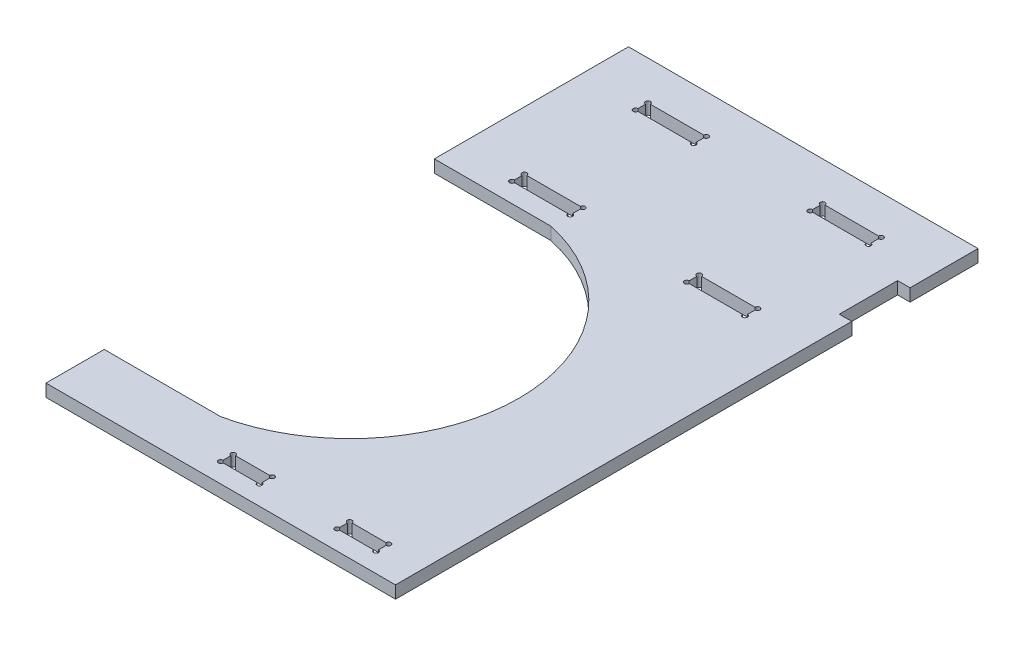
from build123d import *

# Parameters (mm, degrees)
SKETCH1_W           = 50.8
SKETCH1_H           = 16.30000042
SKETCH1_W_2         = 76.2
BOSS_EXTRUDE2_DEPTH = 16.30000042
SKETCH2_R           = 3.175
CUT_EXTRUDE1_DEPTH  = 16.30000042


with BuildPart() as part:
    # Sketch1 → Boss-Extrude2 (new body)
    with BuildSketch(Plane(origin=(0, 0, 0), x_dir=(1, 0, 0), z_dir=(0, 1, 0))):
        with BuildLine():
            Line((0, 0), (457.2, 0))
            Line((457.2, 0), (457.2, 596.9))
            Line((457.2, 596.9), (440.89999958, 596.9))
            Line((440.89999958, 596.9), (440.89999958, 673.1))
            Line((440.89999958, 673.1), (457.2, 673.1))
            Line((457.2, 673.1), (457.2, 762))
            Line((457.2, 762), (0, 762))
            Line((0, 762), (0, 508))
            Line((0, 508), (152.4, 508))
            ThreePointArc((152.4, 508), (326.558897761, 292.1), (152.4, 76.2))
            Line((152.4, 76.2), (0, 76.2))
            Line((0, 76.2), (0, 0))
        make_face()
        with Locations((381, 33.55000021)):
            Rectangle(SKETCH1_W, SKETCH1_H, mode=Mode.SUBTRACT)
        with Locations((114.3, 703.04999979)):
            Rectangle(SKETCH1_W_2, SKETCH1_H, mode=Mode.SUBTRACT)
        with Locations((342.9, 703.04999979)):
            Rectangle(SKETCH1_W_2, SKETCH1_H, mode=Mode.SUBTRACT)
        with Locations((114.3, 541.55000021)):
            Rectangle(SKETCH1_W_2, SKETCH1_H, mode=Mode.SUBTRACT)
        with Locations((342.9, 541.55000021)):
            Rectangle(SKETCH1_W_2, SKETCH1_H, mode=Mode.SUBTRACT)
        with Locations((228.6, 33.55000021)):
            Rectangle(SKETCH1_W, SKETCH1_H, mode=Mode.SUBTRACT)
    extrude(amount=BOSS_EXTRUDE2_DEPTH)

    # Sketch2 → Cut-Extrude1 (cut)
    with BuildSketch(Plane(origin=(0, 16.30000042, 0), x_dir=(1, 0, 0), z_dir=(0, 1, 0))):
        with Locations((152.4, 549.70000042)):
            Circle(SKETCH2_R)
        with Locations((76.2, 549.70000042)):
            Circle(SKETCH2_R)
        with Locations((76.2, 533.4)):
            Circle(SKETCH2_R)
        with Locations((152.4, 533.4)):
            Circle(SKETCH2_R)
        with Locations((152.4, 711.2)):
            Circle(SKETCH2_R)
        with Locations((76.2, 711.2)):
            Circle(SKETCH2_R)
        with Locations((76.2, 694.89999958)):
            Circle(SKETCH2_R)
        with Locations((152.4, 694.89999958)):
            Circle(SKETCH2_R)
        with Locations((381, 711.2)):
            Circle(SKETCH2_R)
        with Locations((381, 694.89999958)):
            Circle(SKETCH2_R)
        with Locations((304.8, 694.89999958)):
            Circle(SKETCH2_R)
        with Locations((304.8, 711.2)):
            Circle(SKETCH2_R)
        with Locations((381, 533.4)):
            Circle(SKETCH2_R)
        with Locations((381, 549.70000042)):
            Circle(SKETCH2_R)
        with Locations((304.8, 549.70000042)):
            Circle(SKETCH2_R)
        with Locations((304.8, 533.4)):
            Circle(SKETCH2_R)
        with Locations((406.4, 25.4)):
            Circle(SKETCH2_R)
        with Locations((406.4, 41.70000042)):
            Circle(SKETCH2_R)
        with Locations((355.6, 41.70000042)):
            Circle(SKETCH2_R)
        with Locations((355.6, 25.4)):
            Circle(SKETCH2_R)
        with Locations((203.2, 41.70000042)):
            Circle(SKETCH2_R)
        with Locations((254, 41.70000042)):
            Circle(SKETCH2_R)
        with Locations((254, 25.4)):
            Circle(SKETCH2_R)
        with Locations((203.2, 25.4)):
            Circle(SKETCH2_R)
    extrude(amount=-CUT_EXTRUDE1_DEPTH, mode=Mode.SUBTRACT)


solid = part.part
